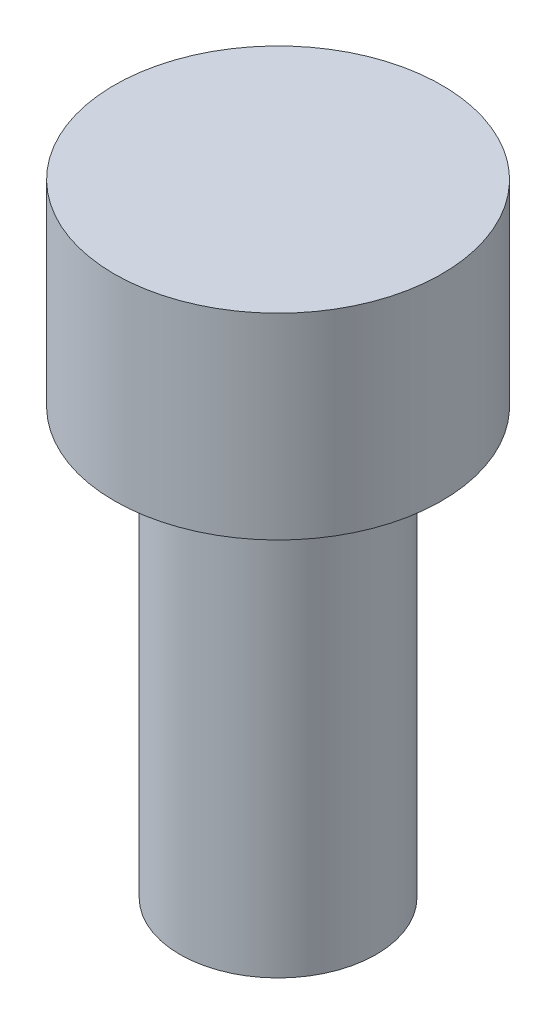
ISO-10303-21;
HEADER;
FILE_DESCRIPTION(('STEP AP214'),'2;1');
FILE_NAME('part.step','',(''),(''),'','','');
FILE_SCHEMA(('AUTOMOTIVE_DESIGN { 1 0 10303 214 1 1 1 1 }'));
ENDSEC;
DATA;
#1=APPLICATION_CONTEXT('core data for automotive mechanical design processes');
#2=APPLICATION_PROTOCOL_DEFINITION('international standard','automotive_design',2000,#1);
#3=PRODUCT_CONTEXT('',#1,'mechanical');
#4=PRODUCT('Part','Part','',(#3));
#5=PRODUCT_RELATED_PRODUCT_CATEGORY('part','',(#4));
#6=PRODUCT_DEFINITION_FORMATION('','',#4);
#7=PRODUCT_DEFINITION_CONTEXT('part definition',#1,'design');
#8=PRODUCT_DEFINITION('design','',#6,#7);
#9=PRODUCT_DEFINITION_SHAPE('','',#8);
#10=(LENGTH_UNIT() NAMED_UNIT(*) SI_UNIT(.MILLI.,.METRE.));
#11=(NAMED_UNIT(*) PLANE_ANGLE_UNIT() SI_UNIT($,.RADIAN.));
#12=(NAMED_UNIT(*) SI_UNIT($,.STERADIAN.) SOLID_ANGLE_UNIT());
#13=UNCERTAINTY_MEASURE_WITH_UNIT(LENGTH_MEASURE(1.E-05),#10,'distance_accuracy_value','');
#14=(GEOMETRIC_REPRESENTATION_CONTEXT(3) GLOBAL_UNCERTAINTY_ASSIGNED_CONTEXT((#13)) GLOBAL_UNIT_ASSIGNED_CONTEXT((#10,
#11,#12)) REPRESENTATION_CONTEXT('',''));
#15=CARTESIAN_POINT('',(0.,0.,0.));
#16=DIRECTION('',(0.,0.,1.));
#17=DIRECTION('',(1.,0.,0.));
#18=AXIS2_PLACEMENT_3D('',#15,#16,#17);
#19=CARTESIAN_POINT('',(0.,6.,0.));
#20=DIRECTION('',(0.,-1.,0.));
#21=DIRECTION('',(0.,0.,-1.));
#22=AXIS2_PLACEMENT_3D('',#19,#20,#21);
#23=CYLINDRICAL_SURFACE('',#22,5.);
#24=CARTESIAN_POINT('',(0.,6.,0.));
#25=DIRECTION('',(0.,1.,0.));
#26=DIRECTION('',(0.,0.,1.));
#27=AXIS2_PLACEMENT_3D('',#24,#25,#26);
#28=CIRCLE('',#27,5.);
#29=CARTESIAN_POINT('',(0.,6.,5.));
#30=VERTEX_POINT('',#29);
#31=EDGE_CURVE('E10',#30,#30,#28,.T.);
#32=ORIENTED_EDGE('',*,*,#31,.F.);
#33=EDGE_LOOP('',(#32));
#34=FACE_BOUND('',#33,.T.);
#35=CARTESIAN_POINT('',(0.,0.,0.));
#36=DIRECTION('',(0.,1.,0.));
#37=DIRECTION('',(0.,0.,1.));
#38=AXIS2_PLACEMENT_3D('',#35,#36,#37);
#39=CIRCLE('',#38,5.);
#40=CARTESIAN_POINT('',(0.,0.,5.));
#41=VERTEX_POINT('',#40);
#42=EDGE_CURVE('E46',#41,#41,#39,.T.);
#43=ORIENTED_EDGE('',*,*,#42,.T.);
#44=EDGE_LOOP('',(#43));
#45=FACE_BOUND('',#44,.T.);
#46=ADVANCED_FACE('F43',(#34,#45),#23,.T.);
#47=CARTESIAN_POINT('',(0.,6.,0.));
#48=DIRECTION('',(0.,1.,0.));
#49=DIRECTION('',(0.,0.,1.));
#50=AXIS2_PLACEMENT_3D('',#47,#48,#49);
#51=PLANE('',#50);
#52=ORIENTED_EDGE('',*,*,#31,.T.);
#53=EDGE_LOOP('',(#52));
#54=FACE_BOUND('',#53,.T.);
#55=ADVANCED_FACE('F79',(#54),#51,.T.);
#56=CARTESIAN_POINT('',(0.,0.,0.));
#57=DIRECTION('',(0.,1.,0.));
#58=DIRECTION('',(0.,0.,1.));
#59=AXIS2_PLACEMENT_3D('',#56,#57,#58);
#60=PLANE('',#59);
#61=CARTESIAN_POINT('',(0.,0.,0.));
#62=DIRECTION('',(0.,1.,0.));
#63=DIRECTION('',(0.,0.,1.));
#64=AXIS2_PLACEMENT_3D('',#61,#62,#63);
#65=CIRCLE('',#64,3.);
#66=CARTESIAN_POINT('',(0.,0.,3.));
#67=VERTEX_POINT('',#66);
#68=EDGE_CURVE('E60',#67,#67,#65,.T.);
#69=ORIENTED_EDGE('',*,*,#68,.T.);
#70=EDGE_LOOP('',(#69));
#71=FACE_BOUND('',#70,.T.);
#72=ORIENTED_EDGE('',*,*,#42,.F.);
#73=EDGE_LOOP('',(#72));
#74=FACE_BOUND('',#73,.T.);
#75=ADVANCED_FACE('F74',(#71,#74),#60,.F.);
#76=CARTESIAN_POINT('',(0.,-13.,0.));
#77=DIRECTION('',(0.,1.,0.));
#78=DIRECTION('',(0.,0.,1.));
#79=AXIS2_PLACEMENT_3D('',#76,#77,#78);
#80=CYLINDRICAL_SURFACE('',#79,3.);
#81=CARTESIAN_POINT('',(0.,-13.,0.));
#82=DIRECTION('',(0.,1.,0.));
#83=DIRECTION('',(0.,0.,1.));
#84=AXIS2_PLACEMENT_3D('',#81,#82,#83);
#85=CIRCLE('',#84,3.);
#86=CARTESIAN_POINT('',(0.,-13.,3.));
#87=VERTEX_POINT('',#86);
#88=EDGE_CURVE('E54',#87,#87,#85,.T.);
#89=CARTESIAN_POINT('',(0.,-13.,3.));
#90=CARTESIAN_POINT('',(0.,-12.8645833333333,3.));
#91=CARTESIAN_POINT('',(0.,-12.7291666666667,3.));
#92=CARTESIAN_POINT('',(0.,-12.4583333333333,3.));
#93=CARTESIAN_POINT('',(0.,-12.3229166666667,3.));
#94=CARTESIAN_POINT('',(0.,-12.0520833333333,3.));
#95=CARTESIAN_POINT('',(0.,-11.9166666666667,3.));
#96=CARTESIAN_POINT('',(0.,-11.6458333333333,3.));
#97=CARTESIAN_POINT('',(0.,-11.5104166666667,3.));
#98=CARTESIAN_POINT('',(0.,-11.2395833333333,3.));
#99=CARTESIAN_POINT('',(0.,-11.1041666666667,3.));
#100=CARTESIAN_POINT('',(0.,-10.8333333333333,3.));
#101=CARTESIAN_POINT('',(0.,-10.6979166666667,3.));
#102=CARTESIAN_POINT('',(0.,-10.4270833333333,3.));
#103=CARTESIAN_POINT('',(0.,-10.2916666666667,3.));
#104=CARTESIAN_POINT('',(0.,-10.0208333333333,3.));
#105=CARTESIAN_POINT('',(0.,-9.88541666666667,3.));
#106=CARTESIAN_POINT('',(0.,-9.61458333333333,3.));
#107=CARTESIAN_POINT('',(0.,-9.47916666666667,3.));
#108=CARTESIAN_POINT('',(0.,-9.20833333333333,3.));
#109=CARTESIAN_POINT('',(0.,-9.07291666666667,3.));
#110=CARTESIAN_POINT('',(0.,-8.80208333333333,3.));
#111=CARTESIAN_POINT('',(0.,-8.66666666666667,3.));
#112=CARTESIAN_POINT('',(0.,-8.39583333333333,3.));
#113=CARTESIAN_POINT('',(0.,-8.26041666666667,3.));
#114=CARTESIAN_POINT('',(0.,-7.98958333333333,3.));
#115=CARTESIAN_POINT('',(0.,-7.85416666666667,3.));
#116=CARTESIAN_POINT('',(0.,-7.58333333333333,3.));
#117=CARTESIAN_POINT('',(0.,-7.44791666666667,3.));
#118=CARTESIAN_POINT('',(0.,-7.17708333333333,3.));
#119=CARTESIAN_POINT('',(0.,-7.04166666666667,3.));
#120=CARTESIAN_POINT('',(0.,-6.77083333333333,3.));
#121=CARTESIAN_POINT('',(0.,-6.63541666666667,3.));
#122=CARTESIAN_POINT('',(0.,-6.36458333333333,3.));
#123=CARTESIAN_POINT('',(0.,-6.22916666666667,3.));
#124=CARTESIAN_POINT('',(0.,-5.95833333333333,3.));
#125=CARTESIAN_POINT('',(0.,-5.82291666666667,3.));
#126=CARTESIAN_POINT('',(0.,-5.55208333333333,3.));
#127=CARTESIAN_POINT('',(0.,-5.41666666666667,3.));
#128=CARTESIAN_POINT('',(0.,-5.14583333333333,3.));
#129=CARTESIAN_POINT('',(0.,-5.01041666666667,3.));
#130=CARTESIAN_POINT('',(0.,-4.73958333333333,3.));
#131=CARTESIAN_POINT('',(0.,-4.60416666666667,3.));
#132=CARTESIAN_POINT('',(0.,-4.33333333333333,3.));
#133=CARTESIAN_POINT('',(0.,-4.19791666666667,3.));
#134=CARTESIAN_POINT('',(0.,-3.92708333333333,3.));
#135=CARTESIAN_POINT('',(0.,-3.79166666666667,3.));
#136=CARTESIAN_POINT('',(0.,-3.52083333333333,3.));
#137=CARTESIAN_POINT('',(0.,-3.38541666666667,3.));
#138=CARTESIAN_POINT('',(0.,-3.11458333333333,3.));
#139=CARTESIAN_POINT('',(0.,-2.97916666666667,3.));
#140=CARTESIAN_POINT('',(0.,-2.70833333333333,3.));
#141=CARTESIAN_POINT('',(0.,-2.57291666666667,3.));
#142=CARTESIAN_POINT('',(0.,-2.30208333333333,3.));
#143=CARTESIAN_POINT('',(0.,-2.16666666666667,3.));
#144=CARTESIAN_POINT('',(0.,-1.89583333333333,3.));
#145=CARTESIAN_POINT('',(0.,-1.76041666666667,3.));
#146=CARTESIAN_POINT('',(0.,-1.48958333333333,3.));
#147=CARTESIAN_POINT('',(0.,-1.35416666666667,3.));
#148=CARTESIAN_POINT('',(0.,-1.08333333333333,3.));
#149=CARTESIAN_POINT('',(0.,-0.947916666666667,3.));
#150=CARTESIAN_POINT('',(0.,-0.677083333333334,3.));
#151=CARTESIAN_POINT('',(0.,-0.541666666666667,3.));
#152=CARTESIAN_POINT('',(0.,-0.270833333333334,3.));
#153=CARTESIAN_POINT('',(0.,-0.135416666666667,3.));
#154=CARTESIAN_POINT('',(0.,0.,3.));
#155=B_SPLINE_CURVE_WITH_KNOTS('',3,(#89,#90,#91,#92,#93,#94,#95,#96,#97,#98,#99,#100,#101,#102,
#103,#104,#105,#106,#107,#108,#109,#110,#111,#112,#113,#114,#115,#116,#117,#118,#119,#120,#121,
#122,#123,#124,#125,#126,#127,#128,#129,#130,#131,#132,#133,#134,#135,#136,#137,#138,#139,#140,
#141,#142,#143,#144,#145,#146,#147,#148,#149,#150,#151,#152,#153,#154),.UNSPECIFIED.,.F.,.F.,(4,
2,2,2,2,2,2,2,2,2,2,2,2,2,2,2,2,2,2,2,2,2,2,2,2,2,2,2,2,2,2,2,4),(0.,0.406249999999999,
0.812499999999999,1.21875,1.625,2.03125,2.4375,2.84375,3.25,3.65625,4.0625,4.46875,4.875,
5.28125,5.6875,6.09375,6.5,6.90625,7.3125,7.71875,8.125,8.53125,8.9375,9.34375,9.75,10.15625,
10.5625,10.96875,11.375,11.78125,12.1875,12.59375,13.),.UNSPECIFIED.);
#156=EDGE_CURVE('BSEAM61',#87,#67,#155,.T.);
#157=ORIENTED_EDGE('',*,*,#88,.T.);
#158=ORIENTED_EDGE('',*,*,#68,.F.);
#159=ORIENTED_EDGE('',*,*,#156,.T.);
#160=ORIENTED_EDGE('',*,*,#156,.F.);
#161=EDGE_LOOP('',(#157,#159,#158,#160));
#162=FACE_BOUND('',#161,.T.);
#163=ADVANCED_FACE('F61',(#162),#80,.T.);
#164=CARTESIAN_POINT('',(0.,-13.,0.));
#165=DIRECTION('',(0.,1.,0.));
#166=DIRECTION('',(0.,0.,1.));
#167=AXIS2_PLACEMENT_3D('',#164,#165,#166);
#168=PLANE('',#167);
#169=ORIENTED_EDGE('',*,*,#88,.F.);
#170=EDGE_LOOP('',(#169));
#171=FACE_BOUND('',#170,.T.);
#172=ADVANCED_FACE('F67',(#171),#168,.F.);
#173=CLOSED_SHELL('',(#46,#55,#75,#163,#172));
#174=MANIFOLD_SOLID_BREP('B2',#173);
#175=ADVANCED_BREP_SHAPE_REPRESENTATION('',(#18,#174),#14);
#176=SHAPE_DEFINITION_REPRESENTATION(#9,#175);
ENDSEC;
END-ISO-10303-21;
